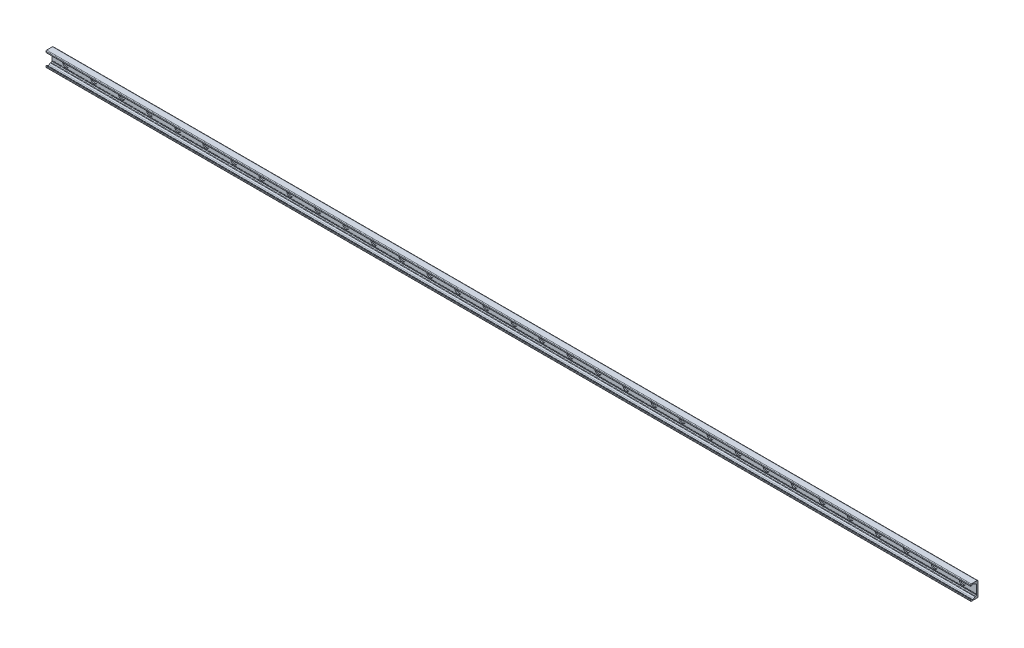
from build123d import *

# Parameters (mm, degrees)
BOSS_EXTRUDE1_DEPTH = 1320
SKETCH2_R           = 9
SKETCH2_R_2         = 4.5
CUT_EXTRUDE1_DEPTH  = 3.1
SKETCH2_2_R         = 4.5
CUT_EXTRUDE2_DEPTH  = 1321.278190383
LPATTERN1_COUNT     = 33
LPATTERN1_PITCH     = 80


with BuildPart() as part:
    # Sketch1 → Boss-Extrude1 (new, symmetric)
    with BuildSketch(Plane(origin=(0, 0, 0), x_dir=(0, 0, -1), z_dir=(1, 0, 0))):
        with BuildLine():
            Line((0, 0), (0, 19))
            ThreePointArc((0, 19), (-0.732233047, 20.767766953), (-2.5, 21.5))
            Line((-2.5, 21.5), (-19, 21.5))
            ThreePointArc((-19, 21.5), (-20.414213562, 20.914213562), (-21, 19.5))
            Line((-21, 19.5), (-21, 16.625057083))
            ThreePointArc((-21, 16.625057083), (-20.553251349, 15.888838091), (-19.693931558, 15.945160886))
            Line((-19.693931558, 15.945160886), (-16.794305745, 17.975500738))
            ThreePointArc((-16.794305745, 17.975500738), (-14.5, 18.69889256), (-12.205694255, 17.975500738))
            Line((-12.205694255, 17.975500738), (-8.829831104, 15.611695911))
            ThreePointArc((-8.829831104, 15.611695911), (-8.28408983, 15.342566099), (-7.682678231, 15.25))
            Line((-7.682678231, 15.25), (-6.5, 15.25))
            ThreePointArc((-6.5, 15.25), (-5.085786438, 14.664213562), (-4.5, 13.25))
            Line((-4.5, 13.25), (-4.5, -10.75))
            ThreePointArc((-4.5, -10.75), (-4.25, -11), (-4.5, -11.25))
            Line((-4.5, -11.25), (-4.5, -12.25))
            ThreePointArc((-4.5, -12.25), (-4.25, -12.5), (-4.5, -12.75))
            Line((-4.5, -12.75), (-4.5, -13.25))
            ThreePointArc((-4.5, -13.25), (-5.085786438, -14.664213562), (-6.5, -15.25))
            Line((-6.5, -15.25), (-7.682678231, -15.25))
            ThreePointArc((-7.682678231, -15.25), (-8.28408983, -15.342566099), (-8.829831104, -15.611695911))
            Line((-8.829831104, -15.611695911), (-12.205694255, -17.975500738))
            ThreePointArc((-12.205694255, -17.975500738), (-14.5, -18.69889256), (-16.794305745, -17.975500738))
            Line((-16.794305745, -17.975500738), (-19.693931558, -15.945160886))
            ThreePointArc((-19.693931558, -15.945160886), (-20.553251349, -15.888838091), (-21, -16.625057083))
            Line((-21, -16.625057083), (-21, -19.5))
            ThreePointArc((-21, -19.5), (-20.414213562, -20.914213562), (-19, -21.5))
            Line((-19, -21.5), (-2.5, -21.5))
            ThreePointArc((-2.5, -21.5), (-0.732233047, -20.767766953), (0, -19))
            Line((0, -19), (0, 0))
        make_face()
    extrude(amount=BOSS_EXTRUDE1_DEPTH, both=True)

    # Sketch2 → Cut-Extrude1 (cut)
    with BuildSketch(Plane.XY.offset(4.5)):
        with Locations((1280, 0)):
            Circle(SKETCH2_R)
        with Locations((1280, 0)):
            Circle(SKETCH2_R_2, mode=Mode.SUBTRACT)
    cut_extrude1 = extrude(amount=-CUT_EXTRUDE1_DEPTH, mode=Mode.SUBTRACT)

    # Sketch2_2 → Cut-Extrude2 (cut, through all)
    with BuildSketch(Plane.XY.offset(4.5)):
        with Locations((1280, 0)):
            Circle(SKETCH2_2_R)
    cut_extrude2 = extrude(amount=-CUT_EXTRUDE2_DEPTH, mode=Mode.SUBTRACT)

    # LPattern1: Cut-Extrude1, Cut-Extrude2 ×33
    with Locations(*[(-i * LPATTERN1_PITCH, 0, 0) for i in range(1, LPATTERN1_COUNT)]):
        add(cut_extrude1, mode=Mode.SUBTRACT)
        add(cut_extrude2, mode=Mode.SUBTRACT)


solid = part.part
